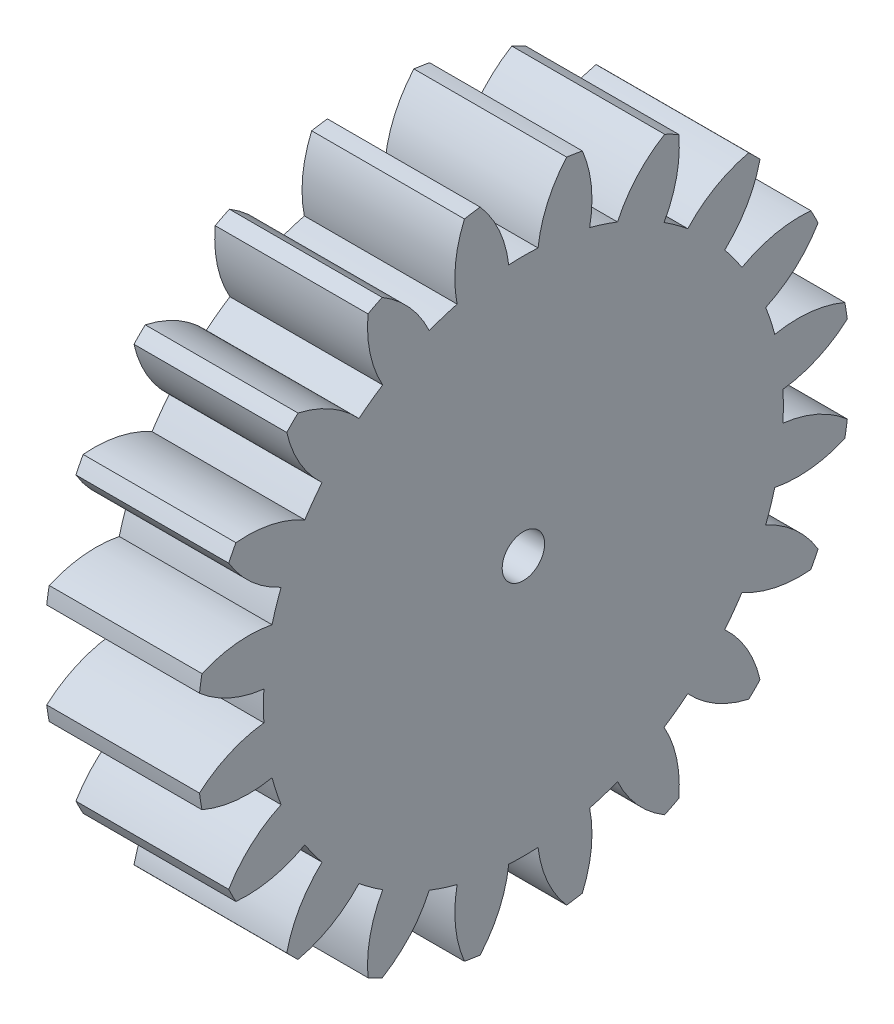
from build123d import *

# Parameters (mm, degrees)
BASPROSKE_W     = 18
BASPROSKE_H     = 38.5
TOOTHCUT_DEPTH  = 58.345444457
TEETHCUTS_COUNT = 20
TEETHCUTS_ANGLE = 342
BORSKE_R        = 2.5
BORE_DEPTH      = 50.0000508


with BuildPart() as part:
    # BasProSke → Base-Revolve (revolve)
    with BuildSketch(Plane(origin=(0, 0, 0), x_dir=(1, 0, 0), z_dir=(0, 1, 0)), mode=Mode.PRIVATE) as base_revolve_sk:
        with Locations((9, 19.25)):
            Rectangle(BASPROSKE_W, BASPROSKE_H)
    revolve(base_revolve_sk.sketch.rotate(Axis((-10, 0, 0), (1, 0, 0)), 180), axis=Axis((-10, 0, 0), (1, 0, 0)))

    # TooCutSke → ToothCut (cut, through all)
    with BuildSketch(Plane(origin=(0, 0, 0), x_dir=(0, 0, -1), z_dir=(1, 0, 0))):
        with BuildLine():
            ThreePointArc((1.725504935, 30.575349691), (0, 30.624), (-1.725504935, 30.575349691))
            ThreePointArc((-1.725504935, 30.575349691), (-2.842155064, 34.637801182), (-5.116866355, 38.184082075))
            ThreePointArc((-5.116866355, 38.184082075), (0, 38.5254), (5.116866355, 38.184082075))
            ThreePointArc((5.116866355, 38.184082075), (2.842155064, 34.637801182), (1.725504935, 30.575349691))
        make_face()
    toothcut = extrude(amount=TOOTHCUT_DEPTH, mode=Mode.SUBTRACT)

    # TeethCuts: ToothCut ×20 about axis
    teethcuts_axis = Axis((-10, 0, 0), (1, 0, 0))
    for i in range(1, TEETHCUTS_COUNT):
        add(toothcut.rotate(teethcuts_axis, i * TEETHCUTS_ANGLE / (TEETHCUTS_COUNT - 1)), mode=Mode.SUBTRACT)

    # BorSke → Bore (cut, symmetric)
    with BuildSketch(Plane(origin=(0, 0, 0), x_dir=(0, 0, -1), z_dir=(1, 0, 0))):
        with Locations(Location((0, 0, 0), (0, 0, 180))):
            Circle(BORSKE_R)
    extrude(amount=BORE_DEPTH, both=True, mode=Mode.SUBTRACT)


solid = part.part
